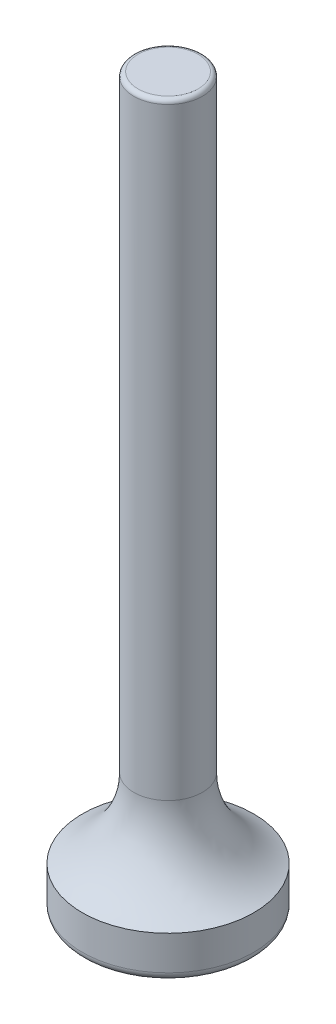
ISO-10303-21;
HEADER;
FILE_DESCRIPTION(('STEP AP214'),'2;1');
FILE_NAME('part.step','',(''),(''),'','','');
FILE_SCHEMA(('AUTOMOTIVE_DESIGN { 1 0 10303 214 1 1 1 1 }'));
ENDSEC;
DATA;
#1=APPLICATION_CONTEXT('core data for automotive mechanical design processes');
#2=APPLICATION_PROTOCOL_DEFINITION('international standard','automotive_design',2000,#1);
#3=PRODUCT_CONTEXT('',#1,'mechanical');
#4=PRODUCT('Part','Part','',(#3));
#5=PRODUCT_RELATED_PRODUCT_CATEGORY('part','',(#4));
#6=PRODUCT_DEFINITION_FORMATION('','',#4);
#7=PRODUCT_DEFINITION_CONTEXT('part definition',#1,'design');
#8=PRODUCT_DEFINITION('design','',#6,#7);
#9=PRODUCT_DEFINITION_SHAPE('','',#8);
#10=(LENGTH_UNIT() NAMED_UNIT(*) SI_UNIT(.MILLI.,.METRE.));
#11=(NAMED_UNIT(*) PLANE_ANGLE_UNIT() SI_UNIT($,.RADIAN.));
#12=(NAMED_UNIT(*) SI_UNIT($,.STERADIAN.) SOLID_ANGLE_UNIT());
#13=UNCERTAINTY_MEASURE_WITH_UNIT(LENGTH_MEASURE(1.E-05),#10,'distance_accuracy_value','');
#14=(GEOMETRIC_REPRESENTATION_CONTEXT(3) GLOBAL_UNCERTAINTY_ASSIGNED_CONTEXT((#13)) GLOBAL_UNIT_ASSIGNED_CONTEXT((#10,
#11,#12)) REPRESENTATION_CONTEXT('',''));
#15=CARTESIAN_POINT('',(0.,0.,0.));
#16=DIRECTION('',(0.,0.,1.));
#17=DIRECTION('',(1.,0.,0.));
#18=AXIS2_PLACEMENT_3D('',#15,#16,#17);
#19=CARTESIAN_POINT('',(0.,80.,0.));
#20=DIRECTION('',(0.,-1.,0.));
#21=DIRECTION('',(0.,0.,-1.));
#22=AXIS2_PLACEMENT_3D('',#19,#20,#21);
#23=CYLINDRICAL_SURFACE('',#22,4.);
#24=CARTESIAN_POINT('',(0.,79.5,0.));
#25=DIRECTION('',(0.,1.,0.));
#26=DIRECTION('',(0.,0.,1.));
#27=AXIS2_PLACEMENT_3D('',#24,#25,#26);
#28=CIRCLE('',#27,4.);
#29=CARTESIAN_POINT('',(0.,79.5,4.));
#30=VERTEX_POINT('',#29);
#31=EDGE_CURVE('E10',#30,#30,#28,.F.);
#32=ORIENTED_EDGE('',*,*,#31,.T.);
#33=EDGE_LOOP('',(#32));
#34=FACE_BOUND('',#33,.T.);
#35=CARTESIAN_POINT('',(0.,9.16515138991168,0.));
#36=DIRECTION('',(0.,-1.,0.));
#37=DIRECTION('',(0.,0.,-1.));
#38=AXIS2_PLACEMENT_3D('',#35,#36,#37);
#39=CIRCLE('',#38,4.);
#40=CARTESIAN_POINT('',(0.,9.16515138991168,-4.));
#41=VERTEX_POINT('',#40);
#42=EDGE_CURVE('E50',#41,#41,#39,.F.);
#43=ORIENTED_EDGE('',*,*,#42,.T.);
#44=EDGE_LOOP('',(#43));
#45=FACE_BOUND('',#44,.T.);
#46=ADVANCED_FACE('F30',(#34,#45),#23,.T.);
#47=CARTESIAN_POINT('',(0.,80.,0.));
#48=DIRECTION('',(0.,1.,0.));
#49=DIRECTION('',(0.,0.,1.));
#50=AXIS2_PLACEMENT_3D('',#47,#48,#49);
#51=PLANE('',#50);
#52=CARTESIAN_POINT('',(0.,80.,0.));
#53=DIRECTION('',(0.,1.,0.));
#54=DIRECTION('',(0.,0.,1.));
#55=AXIS2_PLACEMENT_3D('',#52,#53,#54);
#56=CIRCLE('',#55,3.5);
#57=CARTESIAN_POINT('',(0.,80.,3.5));
#58=VERTEX_POINT('',#57);
#59=EDGE_CURVE('E37',#58,#58,#56,.T.);
#60=ORIENTED_EDGE('',*,*,#59,.T.);
#61=EDGE_LOOP('',(#60));
#62=FACE_BOUND('',#61,.T.);
#63=ADVANCED_FACE('F75',(#62),#51,.T.);
#64=CARTESIAN_POINT('',(0.,-5.,0.));
#65=DIRECTION('',(0.,1.,0.));
#66=DIRECTION('',(0.,0.,1.));
#67=AXIS2_PLACEMENT_3D('',#64,#65,#66);
#68=CYLINDRICAL_SURFACE('',#67,10.);
#69=CARTESIAN_POINT('',(0.,-4.,0.));
#70=DIRECTION('',(0.,-1.,0.));
#71=DIRECTION('',(0.,0.,-1.));
#72=AXIS2_PLACEMENT_3D('',#69,#70,#71);
#73=CIRCLE('',#72,10.);
#74=CARTESIAN_POINT('',(0.,-4.,-10.));
#75=VERTEX_POINT('',#74);
#76=EDGE_CURVE('E41',#75,#75,#73,.F.);
#77=ORIENTED_EDGE('',*,*,#76,.T.);
#78=EDGE_LOOP('',(#77));
#79=FACE_BOUND('',#78,.T.);
#80=CARTESIAN_POINT('',(0.,0.,0.));
#81=DIRECTION('',(0.,-1.,0.));
#82=DIRECTION('',(0.,0.,-1.));
#83=AXIS2_PLACEMENT_3D('',#80,#81,#82);
#84=CIRCLE('',#83,10.);
#85=CARTESIAN_POINT('',(0.,0.,-10.));
#86=VERTEX_POINT('',#85);
#87=EDGE_CURVE('E53',#86,#86,#84,.T.);
#88=ORIENTED_EDGE('',*,*,#87,.T.);
#89=EDGE_LOOP('',(#88));
#90=FACE_BOUND('',#89,.T.);
#91=ADVANCED_FACE('F57',(#79,#90),#68,.T.);
#92=CARTESIAN_POINT('',(0.,-5.,0.));
#93=DIRECTION('',(0.,-1.,0.));
#94=DIRECTION('',(0.,0.,-1.));
#95=AXIS2_PLACEMENT_3D('',#92,#93,#94);
#96=PLANE('',#95);
#97=CARTESIAN_POINT('',(0.,-5.,0.));
#98=DIRECTION('',(0.,-1.,0.));
#99=DIRECTION('',(0.,0.,-1.));
#100=AXIS2_PLACEMENT_3D('',#97,#98,#99);
#101=CIRCLE('',#100,9.);
#102=CARTESIAN_POINT('',(0.,-5.,-9.));
#103=VERTEX_POINT('',#102);
#104=EDGE_CURVE('E45',#103,#103,#101,.T.);
#105=ORIENTED_EDGE('',*,*,#104,.T.);
#106=EDGE_LOOP('',(#105));
#107=FACE_BOUND('',#106,.T.);
#108=ADVANCED_FACE('F62',(#107),#96,.T.);
#109=CARTESIAN_POINT('',(0.,9.16515138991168,0.));
#110=DIRECTION('',(0.,-1.,0.));
#111=DIRECTION('',(0.,0.,-1.));
#112=AXIS2_PLACEMENT_3D('',#109,#110,#111);
#113=TOROIDAL_SURFACE('',#112,14.,10.);
#114=ORIENTED_EDGE('',*,*,#42,.F.);
#115=EDGE_LOOP('',(#114));
#116=FACE_BOUND('',#115,.T.);
#117=ORIENTED_EDGE('',*,*,#87,.F.);
#118=EDGE_LOOP('',(#117));
#119=FACE_BOUND('',#118,.T.);
#120=ADVANCED_FACE('F59',(#116,#119),#113,.F.);
#121=CARTESIAN_POINT('',(0.,-4.,0.));
#122=DIRECTION('',(0.,-1.,0.));
#123=DIRECTION('',(0.,0.,-1.));
#124=AXIS2_PLACEMENT_3D('',#121,#122,#123);
#125=TOROIDAL_SURFACE('',#124,9.,1.);
#126=ORIENTED_EDGE('',*,*,#76,.F.);
#127=EDGE_LOOP('',(#126));
#128=FACE_BOUND('',#127,.T.);
#129=ORIENTED_EDGE('',*,*,#104,.F.);
#130=EDGE_LOOP('',(#129));
#131=FACE_BOUND('',#130,.T.);
#132=ADVANCED_FACE('F61',(#128,#131),#125,.T.);
#133=CARTESIAN_POINT('',(0.,79.5,0.));
#134=DIRECTION('',(0.,1.,0.));
#135=DIRECTION('',(0.,0.,1.));
#136=AXIS2_PLACEMENT_3D('',#133,#134,#135);
#137=TOROIDAL_SURFACE('',#136,3.5,0.5);
#138=ORIENTED_EDGE('',*,*,#31,.F.);
#139=EDGE_LOOP('',(#138));
#140=FACE_BOUND('',#139,.T.);
#141=ORIENTED_EDGE('',*,*,#59,.F.);
#142=EDGE_LOOP('',(#141));
#143=FACE_BOUND('',#142,.T.);
#144=ADVANCED_FACE('F32',(#140,#143),#137,.T.);
#145=CLOSED_SHELL('',(#46,#63,#91,#108,#120,#132,#144));
#146=MANIFOLD_SOLID_BREP('B2',#145);
#147=ADVANCED_BREP_SHAPE_REPRESENTATION('',(#18,#146),#14);
#148=SHAPE_DEFINITION_REPRESENTATION(#9,#147);
ENDSEC;
END-ISO-10303-21;
